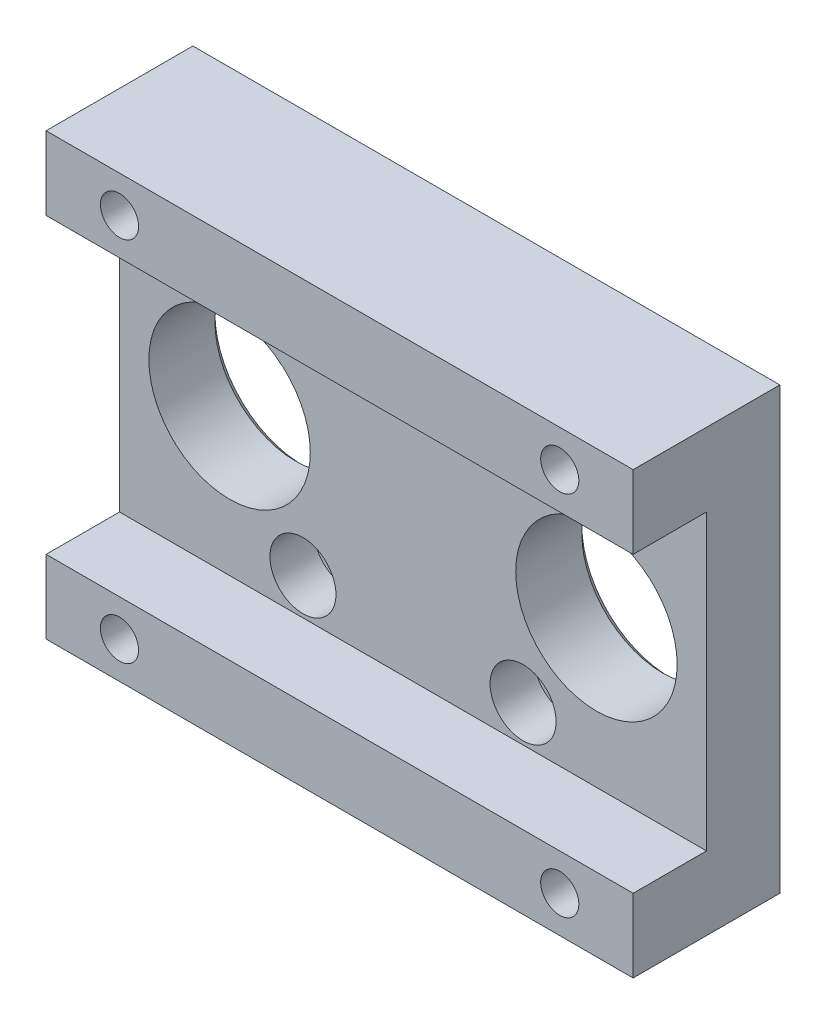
ISO-10303-21;
HEADER;
FILE_DESCRIPTION(('STEP AP214'),'2;1');
FILE_NAME('part.step','',(''),(''),'','','');
FILE_SCHEMA(('AUTOMOTIVE_DESIGN { 1 0 10303 214 1 1 1 1 }'));
ENDSEC;
DATA;
#1=APPLICATION_CONTEXT('core data for automotive mechanical design processes');
#2=APPLICATION_PROTOCOL_DEFINITION('international standard','automotive_design',2000,#1);
#3=PRODUCT_CONTEXT('',#1,'mechanical');
#4=PRODUCT('Part','Part','',(#3));
#5=PRODUCT_RELATED_PRODUCT_CATEGORY('part','',(#4));
#6=PRODUCT_DEFINITION_FORMATION('','',#4);
#7=PRODUCT_DEFINITION_CONTEXT('part definition',#1,'design');
#8=PRODUCT_DEFINITION('design','',#6,#7);
#9=PRODUCT_DEFINITION_SHAPE('','',#8);
#10=(LENGTH_UNIT() NAMED_UNIT(*) SI_UNIT(.MILLI.,.METRE.));
#11=(NAMED_UNIT(*) PLANE_ANGLE_UNIT() SI_UNIT($,.RADIAN.));
#12=(NAMED_UNIT(*) SI_UNIT($,.STERADIAN.) SOLID_ANGLE_UNIT());
#13=UNCERTAINTY_MEASURE_WITH_UNIT(LENGTH_MEASURE(1.E-05),#10,'distance_accuracy_value','');
#14=(GEOMETRIC_REPRESENTATION_CONTEXT(3) GLOBAL_UNCERTAINTY_ASSIGNED_CONTEXT((#13)) GLOBAL_UNIT_ASSIGNED_CONTEXT((#10,
#11,#12)) REPRESENTATION_CONTEXT('',''));
#15=CARTESIAN_POINT('',(0.,0.,0.));
#16=DIRECTION('',(0.,0.,1.));
#17=DIRECTION('',(1.,0.,0.));
#18=AXIS2_PLACEMENT_3D('',#15,#16,#17);
#19=CARTESIAN_POINT('',(15.,15.,10.));
#20=DIRECTION('',(0.,0.,-1.));
#21=DIRECTION('',(-1.,0.,0.));
#22=AXIS2_PLACEMENT_3D('',#19,#20,#21);
#23=CYLINDRICAL_SURFACE('',#22,2.6);
#24=CARTESIAN_POINT('',(15.,15.,0.));
#25=DIRECTION('',(0.,0.,-1.));
#26=DIRECTION('',(-1.,0.,0.));
#27=AXIS2_PLACEMENT_3D('',#24,#25,#26);
#28=CIRCLE('',#27,2.6);
#29=CARTESIAN_POINT('',(12.4,15.,0.));
#30=VERTEX_POINT('',#29);
#31=EDGE_CURVE('E225',#30,#30,#28,.T.);
#32=ORIENTED_EDGE('',*,*,#31,.T.);
#33=EDGE_LOOP('',(#32));
#34=FACE_BOUND('',#33,.T.);
#35=CARTESIAN_POINT('',(15.,15.,4.));
#36=DIRECTION('',(0.,0.,1.));
#37=DIRECTION('',(1.,0.,0.));
#38=AXIS2_PLACEMENT_3D('',#35,#36,#37);
#39=CIRCLE('',#38,2.6);
#40=CARTESIAN_POINT('',(17.6,15.,4.));
#41=VERTEX_POINT('',#40);
#42=EDGE_CURVE('E49',#41,#41,#39,.F.);
#43=ORIENTED_EDGE('',*,*,#42,.F.);
#44=EDGE_LOOP('',(#43));
#45=FACE_BOUND('',#44,.T.);
#46=ADVANCED_FACE('F44',(#34,#45),#23,.F.);
#47=CARTESIAN_POINT('',(-15.,15.,10.));
#48=DIRECTION('',(0.,0.,-1.));
#49=DIRECTION('',(-1.,0.,0.));
#50=AXIS2_PLACEMENT_3D('',#47,#48,#49);
#51=CYLINDRICAL_SURFACE('',#50,2.6);
#52=CARTESIAN_POINT('',(-15.,15.,0.));
#53=DIRECTION('',(0.,0.,-1.));
#54=DIRECTION('',(-1.,0.,0.));
#55=AXIS2_PLACEMENT_3D('',#52,#53,#54);
#56=CIRCLE('',#55,2.6);
#57=CARTESIAN_POINT('',(-17.6,15.,0.));
#58=VERTEX_POINT('',#57);
#59=EDGE_CURVE('E221',#58,#58,#56,.T.);
#60=ORIENTED_EDGE('',*,*,#59,.T.);
#61=EDGE_LOOP('',(#60));
#62=FACE_BOUND('',#61,.T.);
#63=CARTESIAN_POINT('',(-15.,15.,4.));
#64=DIRECTION('',(0.,0.,1.));
#65=DIRECTION('',(1.,0.,0.));
#66=AXIS2_PLACEMENT_3D('',#63,#64,#65);
#67=CIRCLE('',#66,2.6);
#68=CARTESIAN_POINT('',(-12.4,15.,4.));
#69=VERTEX_POINT('',#68);
#70=EDGE_CURVE('E207',#69,#69,#67,.F.);
#71=ORIENTED_EDGE('',*,*,#70,.F.);
#72=EDGE_LOOP('',(#71));
#73=FACE_BOUND('',#72,.T.);
#74=ADVANCED_FACE('F291',(#62,#73),#51,.F.);
#75=CARTESIAN_POINT('',(-15.,-15.,10.));
#76=DIRECTION('',(0.,0.,-1.));
#77=DIRECTION('',(-1.,0.,0.));
#78=AXIS2_PLACEMENT_3D('',#75,#76,#77);
#79=CYLINDRICAL_SURFACE('',#78,2.6);
#80=CARTESIAN_POINT('',(-15.,-15.,0.));
#81=DIRECTION('',(0.,0.,-1.));
#82=DIRECTION('',(-1.,0.,0.));
#83=AXIS2_PLACEMENT_3D('',#80,#81,#82);
#84=CIRCLE('',#83,2.6);
#85=CARTESIAN_POINT('',(-17.6,-15.,0.));
#86=VERTEX_POINT('',#85);
#87=EDGE_CURVE('E216',#86,#86,#84,.T.);
#88=ORIENTED_EDGE('',*,*,#87,.T.);
#89=EDGE_LOOP('',(#88));
#90=FACE_BOUND('',#89,.T.);
#91=CARTESIAN_POINT('',(-15.,-15.,4.));
#92=DIRECTION('',(0.,0.,1.));
#93=DIRECTION('',(1.,0.,0.));
#94=AXIS2_PLACEMENT_3D('',#91,#92,#93);
#95=CIRCLE('',#94,2.6);
#96=CARTESIAN_POINT('',(-12.4,-15.,4.));
#97=VERTEX_POINT('',#96);
#98=EDGE_CURVE('E204',#97,#97,#95,.F.);
#99=ORIENTED_EDGE('',*,*,#98,.F.);
#100=EDGE_LOOP('',(#99));
#101=FACE_BOUND('',#100,.T.);
#102=ADVANCED_FACE('F298',(#90,#101),#79,.F.);
#103=CARTESIAN_POINT('',(15.,-15.,10.));
#104=DIRECTION('',(0.,0.,-1.));
#105=DIRECTION('',(-1.,0.,0.));
#106=AXIS2_PLACEMENT_3D('',#103,#104,#105);
#107=CYLINDRICAL_SURFACE('',#106,2.6);
#108=CARTESIAN_POINT('',(15.,-15.,0.));
#109=DIRECTION('',(0.,0.,-1.));
#110=DIRECTION('',(-1.,0.,0.));
#111=AXIS2_PLACEMENT_3D('',#108,#109,#110);
#112=CIRCLE('',#111,2.6);
#113=CARTESIAN_POINT('',(12.4,-15.,0.));
#114=VERTEX_POINT('',#113);
#115=EDGE_CURVE('E212',#114,#114,#112,.T.);
#116=ORIENTED_EDGE('',*,*,#115,.T.);
#117=EDGE_LOOP('',(#116));
#118=FACE_BOUND('',#117,.T.);
#119=CARTESIAN_POINT('',(15.,-15.,4.));
#120=DIRECTION('',(0.,0.,1.));
#121=DIRECTION('',(1.,0.,0.));
#122=AXIS2_PLACEMENT_3D('',#119,#120,#121);
#123=CIRCLE('',#122,2.6);
#124=CARTESIAN_POINT('',(17.6,-15.,4.));
#125=VERTEX_POINT('',#124);
#126=EDGE_CURVE('E201',#125,#125,#123,.F.);
#127=ORIENTED_EDGE('',*,*,#126,.F.);
#128=EDGE_LOOP('',(#127));
#129=FACE_BOUND('',#128,.T.);
#130=ADVANCED_FACE('F304',(#118,#129),#107,.F.);
#131=CARTESIAN_POINT('',(-30.,-25.,0.));
#132=DIRECTION('',(0.,0.,1.));
#133=DIRECTION('',(1.,0.,0.));
#134=AXIS2_PLACEMENT_3D('',#131,#132,#133);
#135=CYLINDRICAL_SURFACE('',#134,2.6);
#136=CARTESIAN_POINT('',(-30.,-25.,20.));
#137=DIRECTION('',(0.,0.,1.));
#138=DIRECTION('',(1.,0.,0.));
#139=AXIS2_PLACEMENT_3D('',#136,#137,#138);
#140=CIRCLE('',#139,2.6);
#141=CARTESIAN_POINT('',(-27.4,-25.,20.));
#142=VERTEX_POINT('',#141);
#143=EDGE_CURVE('E261',#142,#142,#140,.T.);
#144=ORIENTED_EDGE('',*,*,#143,.T.);
#145=EDGE_LOOP('',(#144));
#146=FACE_BOUND('',#145,.T.);
#147=CARTESIAN_POINT('',(-30.,-25.,5.3));
#148=DIRECTION('',(0.,0.,-1.));
#149=DIRECTION('',(-1.,0.,0.));
#150=AXIS2_PLACEMENT_3D('',#147,#148,#149);
#151=CIRCLE('',#150,2.6);
#152=CARTESIAN_POINT('',(-32.6,-25.,5.3));
#153=VERTEX_POINT('',#152);
#154=EDGE_CURVE('E197',#153,#153,#151,.F.);
#155=ORIENTED_EDGE('',*,*,#154,.F.);
#156=EDGE_LOOP('',(#155));
#157=FACE_BOUND('',#156,.T.);
#158=ADVANCED_FACE('F352',(#146,#157),#135,.F.);
#159=CARTESIAN_POINT('',(30.,-25.,0.));
#160=DIRECTION('',(0.,0.,1.));
#161=DIRECTION('',(1.,0.,0.));
#162=AXIS2_PLACEMENT_3D('',#159,#160,#161);
#163=CYLINDRICAL_SURFACE('',#162,2.6);
#164=CARTESIAN_POINT('',(30.,-25.,20.));
#165=DIRECTION('',(0.,0.,1.));
#166=DIRECTION('',(1.,0.,0.));
#167=AXIS2_PLACEMENT_3D('',#164,#165,#166);
#168=CIRCLE('',#167,2.6);
#169=CARTESIAN_POINT('',(32.6,-25.,20.));
#170=VERTEX_POINT('',#169);
#171=EDGE_CURVE('E254',#170,#170,#168,.T.);
#172=ORIENTED_EDGE('',*,*,#171,.T.);
#173=EDGE_LOOP('',(#172));
#174=FACE_BOUND('',#173,.T.);
#175=CARTESIAN_POINT('',(30.,-25.,5.3));
#176=DIRECTION('',(0.,0.,-1.));
#177=DIRECTION('',(-1.,0.,0.));
#178=AXIS2_PLACEMENT_3D('',#175,#176,#177);
#179=CIRCLE('',#178,2.6);
#180=CARTESIAN_POINT('',(27.4,-25.,5.3));
#181=VERTEX_POINT('',#180);
#182=EDGE_CURVE('E194',#181,#181,#179,.F.);
#183=ORIENTED_EDGE('',*,*,#182,.F.);
#184=EDGE_LOOP('',(#183));
#185=FACE_BOUND('',#184,.T.);
#186=ADVANCED_FACE('F355',(#174,#185),#163,.F.);
#187=CARTESIAN_POINT('',(30.,25.,0.));
#188=DIRECTION('',(0.,0.,1.));
#189=DIRECTION('',(1.,0.,0.));
#190=AXIS2_PLACEMENT_3D('',#187,#188,#189);
#191=CYLINDRICAL_SURFACE('',#190,2.6);
#192=CARTESIAN_POINT('',(30.,25.,20.));
#193=DIRECTION('',(0.,0.,1.));
#194=DIRECTION('',(1.,0.,0.));
#195=AXIS2_PLACEMENT_3D('',#192,#193,#194);
#196=CIRCLE('',#195,2.6);
#197=CARTESIAN_POINT('',(32.6,25.,20.));
#198=VERTEX_POINT('',#197);
#199=EDGE_CURVE('E260',#198,#198,#196,.T.);
#200=ORIENTED_EDGE('',*,*,#199,.T.);
#201=EDGE_LOOP('',(#200));
#202=FACE_BOUND('',#201,.T.);
#203=CARTESIAN_POINT('',(30.,25.,5.3));
#204=DIRECTION('',(0.,0.,-1.));
#205=DIRECTION('',(-1.,0.,0.));
#206=AXIS2_PLACEMENT_3D('',#203,#204,#205);
#207=CIRCLE('',#206,2.6);
#208=CARTESIAN_POINT('',(27.4,25.,5.3));
#209=VERTEX_POINT('',#208);
#210=EDGE_CURVE('E190',#209,#209,#207,.F.);
#211=ORIENTED_EDGE('',*,*,#210,.F.);
#212=EDGE_LOOP('',(#211));
#213=FACE_BOUND('',#212,.T.);
#214=ADVANCED_FACE('F350',(#202,#213),#191,.F.);
#215=CARTESIAN_POINT('',(-30.,25.,0.));
#216=DIRECTION('',(0.,0.,1.));
#217=DIRECTION('',(1.,0.,0.));
#218=AXIS2_PLACEMENT_3D('',#215,#216,#217);
#219=CYLINDRICAL_SURFACE('',#218,2.6);
#220=CARTESIAN_POINT('',(-30.,25.,20.));
#221=DIRECTION('',(0.,0.,1.));
#222=DIRECTION('',(1.,0.,0.));
#223=AXIS2_PLACEMENT_3D('',#220,#221,#222);
#224=CIRCLE('',#223,2.6);
#225=CARTESIAN_POINT('',(-27.4,25.,20.));
#226=VERTEX_POINT('',#225);
#227=EDGE_CURVE('E257',#226,#226,#224,.T.);
#228=ORIENTED_EDGE('',*,*,#227,.T.);
#229=EDGE_LOOP('',(#228));
#230=FACE_BOUND('',#229,.T.);
#231=CARTESIAN_POINT('',(-30.,25.,5.3));
#232=DIRECTION('',(0.,0.,-1.));
#233=DIRECTION('',(-1.,0.,0.));
#234=AXIS2_PLACEMENT_3D('',#231,#232,#233);
#235=CIRCLE('',#234,2.6);
#236=CARTESIAN_POINT('',(-32.6,25.,5.3));
#237=VERTEX_POINT('',#236);
#238=EDGE_CURVE('E187',#237,#237,#235,.F.);
#239=ORIENTED_EDGE('',*,*,#238,.F.);
#240=EDGE_LOOP('',(#239));
#241=FACE_BOUND('',#240,.T.);
#242=ADVANCED_FACE('F346',(#230,#241),#219,.F.);
#243=CARTESIAN_POINT('',(0.,0.,10.));
#244=DIRECTION('',(0.,0.,1.));
#245=DIRECTION('',(1.,0.,0.));
#246=AXIS2_PLACEMENT_3D('',#243,#244,#245);
#247=PLANE('',#246);
#248=CARTESIAN_POINT('',(15.,-15.,10.));
#249=DIRECTION('',(0.,0.,1.));
#250=DIRECTION('',(1.,0.,0.));
#251=AXIS2_PLACEMENT_3D('',#248,#249,#250);
#252=CIRCLE('',#251,4.5);
#253=CARTESIAN_POINT('',(19.5,-15.,10.));
#254=VERTEX_POINT('',#253);
#255=EDGE_CURVE('E425',#254,#254,#252,.T.);
#256=ORIENTED_EDGE('',*,*,#255,.F.);
#257=EDGE_LOOP('',(#256));
#258=FACE_BOUND('',#257,.T.);
#259=CARTESIAN_POINT('',(-15.,-15.,10.));
#260=DIRECTION('',(0.,0.,1.));
#261=DIRECTION('',(1.,0.,0.));
#262=AXIS2_PLACEMENT_3D('',#259,#260,#261);
#263=CIRCLE('',#262,4.5);
#264=CARTESIAN_POINT('',(-10.5,-15.,10.));
#265=VERTEX_POINT('',#264);
#266=EDGE_CURVE('E429',#265,#265,#263,.T.);
#267=ORIENTED_EDGE('',*,*,#266,.F.);
#268=EDGE_LOOP('',(#267));
#269=FACE_BOUND('',#268,.T.);
#270=CARTESIAN_POINT('',(-15.,15.,10.));
#271=DIRECTION('',(0.,0.,1.));
#272=DIRECTION('',(1.,0.,0.));
#273=AXIS2_PLACEMENT_3D('',#270,#271,#272);
#274=CIRCLE('',#273,4.5);
#275=CARTESIAN_POINT('',(-10.5,15.,10.));
#276=VERTEX_POINT('',#275);
#277=EDGE_CURVE('E433',#276,#276,#274,.T.);
#278=ORIENTED_EDGE('',*,*,#277,.F.);
#279=EDGE_LOOP('',(#278));
#280=FACE_BOUND('',#279,.T.);
#281=CARTESIAN_POINT('',(15.,15.,10.));
#282=DIRECTION('',(0.,0.,1.));
#283=DIRECTION('',(1.,0.,0.));
#284=AXIS2_PLACEMENT_3D('',#281,#282,#283);
#285=CIRCLE('',#284,4.5);
#286=CARTESIAN_POINT('',(19.5,15.,10.));
#287=VERTEX_POINT('',#286);
#288=EDGE_CURVE('E437',#287,#287,#285,.T.);
#289=ORIENTED_EDGE('',*,*,#288,.F.);
#290=EDGE_LOOP('',(#289));
#291=FACE_BOUND('',#290,.T.);
#292=CARTESIAN_POINT('',(-25.,0.,10.));
#293=DIRECTION('',(0.,0.,1.));
#294=DIRECTION('',(1.,0.,0.));
#295=AXIS2_PLACEMENT_3D('',#292,#293,#294);
#296=CIRCLE('',#295,11.);
#297=CARTESIAN_POINT('',(-14.,0.,10.));
#298=VERTEX_POINT('',#297);
#299=EDGE_CURVE('E251',#298,#298,#296,.T.);
#300=ORIENTED_EDGE('',*,*,#299,.F.);
#301=EDGE_LOOP('',(#300));
#302=FACE_BOUND('',#301,.T.);
#303=CARTESIAN_POINT('',(25.,0.,10.));
#304=DIRECTION('',(0.,0.,1.));
#305=DIRECTION('',(1.,0.,0.));
#306=AXIS2_PLACEMENT_3D('',#303,#304,#305);
#307=CIRCLE('',#306,11.);
#308=CARTESIAN_POINT('',(36.,0.,10.));
#309=VERTEX_POINT('',#308);
#310=EDGE_CURVE('E200',#309,#309,#307,.T.);
#311=ORIENTED_EDGE('',*,*,#310,.F.);
#312=EDGE_LOOP('',(#311));
#313=FACE_BOUND('',#312,.T.);
#314=DIRECTION('',(0.,-1.,0.));
#315=VECTOR('',#314,1.);
#316=CARTESIAN_POINT('',(-40.,30.,10.));
#317=LINE('',#316,#315);
#318=CARTESIAN_POINT('',(-40.,20.,10.));
#319=VERTEX_POINT('',#318);
#320=CARTESIAN_POINT('',(-40.,-20.,10.));
#321=VERTEX_POINT('',#320);
#322=EDGE_CURVE('E67',#319,#321,#317,.T.);
#323=ORIENTED_EDGE('',*,*,#322,.T.);
#324=DIRECTION('',(-1.,0.,0.));
#325=VECTOR('',#324,1.);
#326=CARTESIAN_POINT('',(40.,-20.,10.));
#327=LINE('',#326,#325);
#328=CARTESIAN_POINT('',(40.,-20.,10.));
#329=VERTEX_POINT('',#328);
#330=EDGE_CURVE('E62',#329,#321,#327,.T.);
#331=ORIENTED_EDGE('',*,*,#330,.F.);
#332=DIRECTION('',(0.,1.,0.));
#333=VECTOR('',#332,1.);
#334=CARTESIAN_POINT('',(40.,30.,10.));
#335=LINE('',#334,#333);
#336=CARTESIAN_POINT('',(40.,20.,10.));
#337=VERTEX_POINT('',#336);
#338=EDGE_CURVE('E163',#329,#337,#335,.T.);
#339=ORIENTED_EDGE('',*,*,#338,.T.);
#340=DIRECTION('',(1.,0.,0.));
#341=VECTOR('',#340,1.);
#342=CARTESIAN_POINT('',(-40.,20.,10.));
#343=LINE('',#342,#341);
#344=EDGE_CURVE('E138',#319,#337,#343,.T.);
#345=ORIENTED_EDGE('',*,*,#344,.F.);
#346=EDGE_LOOP('',(#323,#331,#339,#345));
#347=FACE_BOUND('',#346,.T.);
#348=ADVANCED_FACE('F349',(#258,#269,#280,#291,#302,#313,#347),#247,.T.);
#349=CARTESIAN_POINT('',(40.,30.,10.));
#350=DIRECTION('',(-1.,0.,0.));
#351=DIRECTION('',(0.,-1.,0.));
#352=AXIS2_PLACEMENT_3D('',#349,#350,#351);
#353=PLANE('',#352);
#354=DIRECTION('',(0.,1.,0.));
#355=VECTOR('',#354,1.);
#356=CARTESIAN_POINT('',(40.,30.,0.));
#357=LINE('',#356,#355);
#358=CARTESIAN_POINT('',(40.,-30.,0.));
#359=VERTEX_POINT('',#358);
#360=CARTESIAN_POINT('',(40.,30.,0.));
#361=VERTEX_POINT('',#360);
#362=EDGE_CURVE('E162',#359,#361,#357,.T.);
#363=ORIENTED_EDGE('',*,*,#362,.T.);
#364=DIRECTION('',(0.,0.,-1.));
#365=VECTOR('',#364,1.);
#366=CARTESIAN_POINT('',(40.,30.,10.));
#367=LINE('',#366,#365);
#368=CARTESIAN_POINT('',(40.,30.,20.));
#369=VERTEX_POINT('',#368);
#370=EDGE_CURVE('E176',#369,#361,#367,.T.);
#371=ORIENTED_EDGE('',*,*,#370,.F.);
#372=DIRECTION('',(0.,1.,0.));
#373=VECTOR('',#372,1.);
#374=CARTESIAN_POINT('',(40.,30.,20.));
#375=LINE('',#374,#373);
#376=CARTESIAN_POINT('',(40.,20.,20.));
#377=VERTEX_POINT('',#376);
#378=EDGE_CURVE('E148',#377,#369,#375,.T.);
#379=ORIENTED_EDGE('',*,*,#378,.F.);
#380=DIRECTION('',(0.,0.,-1.));
#381=VECTOR('',#380,1.);
#382=CARTESIAN_POINT('',(40.,20.,20.));
#383=LINE('',#382,#381);
#384=EDGE_CURVE('E154',#377,#337,#383,.T.);
#385=ORIENTED_EDGE('',*,*,#384,.T.);
#386=ORIENTED_EDGE('',*,*,#338,.F.);
#387=DIRECTION('',(0.,0.,-1.));
#388=VECTOR('',#387,1.);
#389=CARTESIAN_POINT('',(40.,-20.,20.));
#390=LINE('',#389,#388);
#391=CARTESIAN_POINT('',(40.,-20.,20.));
#392=VERTEX_POINT('',#391);
#393=EDGE_CURVE('E135',#392,#329,#390,.T.);
#394=ORIENTED_EDGE('',*,*,#393,.F.);
#395=DIRECTION('',(0.,1.,0.));
#396=VECTOR('',#395,1.);
#397=CARTESIAN_POINT('',(40.,-30.,20.));
#398=LINE('',#397,#396);
#399=CARTESIAN_POINT('',(40.,-30.,20.));
#400=VERTEX_POINT('',#399);
#401=EDGE_CURVE('E127',#400,#392,#398,.T.);
#402=ORIENTED_EDGE('',*,*,#401,.F.);
#403=DIRECTION('',(0.,0.,-1.));
#404=VECTOR('',#403,1.);
#405=CARTESIAN_POINT('',(40.,-30.,10.));
#406=LINE('',#405,#404);
#407=EDGE_CURVE('E110',#400,#359,#406,.T.);
#408=ORIENTED_EDGE('',*,*,#407,.T.);
#409=EDGE_LOOP('',(#363,#371,#379,#385,#386,#394,#402,#408));
#410=FACE_BOUND('',#409,.T.);
#411=ADVANCED_FACE('F133',(#410),#353,.F.);
#412=CARTESIAN_POINT('',(-40.,30.,10.));
#413=DIRECTION('',(0.,-1.,0.));
#414=DIRECTION('',(0.,0.,-1.));
#415=AXIS2_PLACEMENT_3D('',#412,#413,#414);
#416=PLANE('',#415);
#417=DIRECTION('',(-1.,0.,0.));
#418=VECTOR('',#417,1.);
#419=CARTESIAN_POINT('',(-40.,30.,0.));
#420=LINE('',#419,#418);
#421=CARTESIAN_POINT('',(-40.,30.,0.));
#422=VERTEX_POINT('',#421);
#423=EDGE_CURVE('E167',#361,#422,#420,.T.);
#424=ORIENTED_EDGE('',*,*,#423,.T.);
#425=DIRECTION('',(0.,0.,-1.));
#426=VECTOR('',#425,1.);
#427=CARTESIAN_POINT('',(-40.,30.,10.));
#428=LINE('',#427,#426);
#429=CARTESIAN_POINT('',(-40.,30.,20.));
#430=VERTEX_POINT('',#429);
#431=EDGE_CURVE('E173',#430,#422,#428,.T.);
#432=ORIENTED_EDGE('',*,*,#431,.F.);
#433=DIRECTION('',(-1.,0.,0.));
#434=VECTOR('',#433,1.);
#435=CARTESIAN_POINT('',(-40.,30.,20.));
#436=LINE('',#435,#434);
#437=EDGE_CURVE('E151',#369,#430,#436,.T.);
#438=ORIENTED_EDGE('',*,*,#437,.F.);
#439=ORIENTED_EDGE('',*,*,#370,.T.);
#440=EDGE_LOOP('',(#424,#432,#438,#439));
#441=FACE_BOUND('',#440,.T.);
#442=ADVANCED_FACE('F375',(#441),#416,.F.);
#443=CARTESIAN_POINT('',(-40.,30.,10.));
#444=DIRECTION('',(1.,0.,0.));
#445=DIRECTION('',(0.,1.,0.));
#446=AXIS2_PLACEMENT_3D('',#443,#444,#445);
#447=PLANE('',#446);
#448=DIRECTION('',(0.,-1.,0.));
#449=VECTOR('',#448,1.);
#450=CARTESIAN_POINT('',(-40.,30.,0.));
#451=LINE('',#450,#449);
#452=CARTESIAN_POINT('',(-40.,-30.,0.));
#453=VERTEX_POINT('',#452);
#454=EDGE_CURVE('E169',#422,#453,#451,.T.);
#455=ORIENTED_EDGE('',*,*,#454,.T.);
#456=DIRECTION('',(0.,0.,-1.));
#457=VECTOR('',#456,1.);
#458=CARTESIAN_POINT('',(-40.,-30.,10.));
#459=LINE('',#458,#457);
#460=CARTESIAN_POINT('',(-40.,-30.,20.));
#461=VERTEX_POINT('',#460);
#462=EDGE_CURVE('E121',#461,#453,#459,.T.);
#463=ORIENTED_EDGE('',*,*,#462,.F.);
#464=DIRECTION('',(0.,-1.,0.));
#465=VECTOR('',#464,1.);
#466=CARTESIAN_POINT('',(-40.,-30.,20.));
#467=LINE('',#466,#465);
#468=CARTESIAN_POINT('',(-40.,-20.,20.));
#469=VERTEX_POINT('',#468);
#470=EDGE_CURVE('E130',#469,#461,#467,.T.);
#471=ORIENTED_EDGE('',*,*,#470,.F.);
#472=DIRECTION('',(0.,0.,-1.));
#473=VECTOR('',#472,1.);
#474=CARTESIAN_POINT('',(-40.,-20.,20.));
#475=LINE('',#474,#473);
#476=EDGE_CURVE('E131',#469,#321,#475,.T.);
#477=ORIENTED_EDGE('',*,*,#476,.T.);
#478=ORIENTED_EDGE('',*,*,#322,.F.);
#479=DIRECTION('',(0.,0.,-1.));
#480=VECTOR('',#479,1.);
#481=CARTESIAN_POINT('',(-40.,20.,20.));
#482=LINE('',#481,#480);
#483=CARTESIAN_POINT('',(-40.,20.,20.));
#484=VERTEX_POINT('',#483);
#485=EDGE_CURVE('E159',#484,#319,#482,.T.);
#486=ORIENTED_EDGE('',*,*,#485,.F.);
#487=DIRECTION('',(0.,-1.,0.));
#488=VECTOR('',#487,1.);
#489=CARTESIAN_POINT('',(-40.,30.,20.));
#490=LINE('',#489,#488);
#491=EDGE_CURVE('E143',#430,#484,#490,.T.);
#492=ORIENTED_EDGE('',*,*,#491,.F.);
#493=ORIENTED_EDGE('',*,*,#431,.T.);
#494=EDGE_LOOP('',(#455,#463,#471,#477,#478,#486,#492,#493));
#495=FACE_BOUND('',#494,.T.);
#496=ADVANCED_FACE('F272',(#495),#447,.F.);
#497=CARTESIAN_POINT('',(-40.,-30.,10.));
#498=DIRECTION('',(0.,1.,0.));
#499=DIRECTION('',(0.,0.,1.));
#500=AXIS2_PLACEMENT_3D('',#497,#498,#499);
#501=PLANE('',#500);
#502=DIRECTION('',(1.,0.,0.));
#503=VECTOR('',#502,1.);
#504=CARTESIAN_POINT('',(-40.,-30.,0.));
#505=LINE('',#504,#503);
#506=EDGE_CURVE('E116',#453,#359,#505,.T.);
#507=ORIENTED_EDGE('',*,*,#506,.T.);
#508=ORIENTED_EDGE('',*,*,#407,.F.);
#509=DIRECTION('',(1.,0.,0.));
#510=VECTOR('',#509,1.);
#511=CARTESIAN_POINT('',(40.,-30.,20.));
#512=LINE('',#511,#510);
#513=EDGE_CURVE('E114',#461,#400,#512,.T.);
#514=ORIENTED_EDGE('',*,*,#513,.F.);
#515=ORIENTED_EDGE('',*,*,#462,.T.);
#516=EDGE_LOOP('',(#507,#508,#514,#515));
#517=FACE_BOUND('',#516,.T.);
#518=ADVANCED_FACE('F112',(#517),#501,.F.);
#519=CARTESIAN_POINT('',(0.,0.,0.));
#520=DIRECTION('',(0.,0.,1.));
#521=DIRECTION('',(1.,0.,0.));
#522=AXIS2_PLACEMENT_3D('',#519,#520,#521);
#523=PLANE('',#522);
#524=ORIENTED_EDGE('',*,*,#115,.F.);
#525=EDGE_LOOP('',(#524));
#526=FACE_BOUND('',#525,.T.);
#527=ORIENTED_EDGE('',*,*,#87,.F.);
#528=EDGE_LOOP('',(#527));
#529=FACE_BOUND('',#528,.T.);
#530=ORIENTED_EDGE('',*,*,#59,.F.);
#531=EDGE_LOOP('',(#530));
#532=FACE_BOUND('',#531,.T.);
#533=ORIENTED_EDGE('',*,*,#31,.F.);
#534=EDGE_LOOP('',(#533));
#535=FACE_BOUND('',#534,.T.);
#536=CARTESIAN_POINT('',(30.,-25.,0.));
#537=DIRECTION('',(0.,0.,-1.));
#538=DIRECTION('',(-1.,0.,0.));
#539=AXIS2_PLACEMENT_3D('',#536,#537,#538);
#540=CIRCLE('',#539,4.5);
#541=CARTESIAN_POINT('',(25.5,-25.,0.));
#542=VERTEX_POINT('',#541);
#543=EDGE_CURVE('E242',#542,#542,#540,.T.);
#544=ORIENTED_EDGE('',*,*,#543,.F.);
#545=EDGE_LOOP('',(#544));
#546=FACE_BOUND('',#545,.T.);
#547=CARTESIAN_POINT('',(-30.,-25.,0.));
#548=DIRECTION('',(0.,0.,-1.));
#549=DIRECTION('',(-1.,0.,0.));
#550=AXIS2_PLACEMENT_3D('',#547,#548,#549);
#551=CIRCLE('',#550,4.5);
#552=CARTESIAN_POINT('',(-34.5,-25.,0.));
#553=VERTEX_POINT('',#552);
#554=EDGE_CURVE('E236',#553,#553,#551,.T.);
#555=ORIENTED_EDGE('',*,*,#554,.F.);
#556=EDGE_LOOP('',(#555));
#557=FACE_BOUND('',#556,.T.);
#558=CARTESIAN_POINT('',(-30.,25.,0.));
#559=DIRECTION('',(0.,0.,-1.));
#560=DIRECTION('',(-1.,0.,0.));
#561=AXIS2_PLACEMENT_3D('',#558,#559,#560);
#562=CIRCLE('',#561,4.5);
#563=CARTESIAN_POINT('',(-34.5,25.,0.));
#564=VERTEX_POINT('',#563);
#565=EDGE_CURVE('E229',#564,#564,#562,.T.);
#566=ORIENTED_EDGE('',*,*,#565,.F.);
#567=EDGE_LOOP('',(#566));
#568=FACE_BOUND('',#567,.T.);
#569=CARTESIAN_POINT('',(30.,25.,0.));
#570=DIRECTION('',(0.,0.,-1.));
#571=DIRECTION('',(-1.,0.,0.));
#572=AXIS2_PLACEMENT_3D('',#569,#570,#571);
#573=CIRCLE('',#572,4.5);
#574=CARTESIAN_POINT('',(25.5,25.,0.));
#575=VERTEX_POINT('',#574);
#576=EDGE_CURVE('E232',#575,#575,#573,.T.);
#577=ORIENTED_EDGE('',*,*,#576,.F.);
#578=EDGE_LOOP('',(#577));
#579=FACE_BOUND('',#578,.T.);
#580=CARTESIAN_POINT('',(25.,0.,0.));
#581=DIRECTION('',(0.,0.,1.));
#582=DIRECTION('',(1.,0.,0.));
#583=AXIS2_PLACEMENT_3D('',#580,#581,#582);
#584=CIRCLE('',#583,12.);
#585=CARTESIAN_POINT('',(37.,0.,0.));
#586=VERTEX_POINT('',#585);
#587=EDGE_CURVE('E182',#586,#586,#584,.T.);
#588=ORIENTED_EDGE('',*,*,#587,.T.);
#589=EDGE_LOOP('',(#588));
#590=FACE_BOUND('',#589,.T.);
#591=CARTESIAN_POINT('',(-25.,0.,0.));
#592=DIRECTION('',(0.,0.,1.));
#593=DIRECTION('',(1.,0.,0.));
#594=AXIS2_PLACEMENT_3D('',#591,#592,#593);
#595=CIRCLE('',#594,12.);
#596=CARTESIAN_POINT('',(-13.,0.,0.));
#597=VERTEX_POINT('',#596);
#598=EDGE_CURVE('E179',#597,#597,#595,.T.);
#599=ORIENTED_EDGE('',*,*,#598,.T.);
#600=EDGE_LOOP('',(#599));
#601=FACE_BOUND('',#600,.T.);
#602=ORIENTED_EDGE('',*,*,#362,.F.);
#603=ORIENTED_EDGE('',*,*,#506,.F.);
#604=ORIENTED_EDGE('',*,*,#454,.F.);
#605=ORIENTED_EDGE('',*,*,#423,.F.);
#606=EDGE_LOOP('',(#602,#603,#604,#605));
#607=FACE_BOUND('',#606,.T.);
#608=ADVANCED_FACE('F378',(#526,#529,#532,#535,#546,#557,#568,#579,#590,#601,#607),#523,.F.);
#609=CARTESIAN_POINT('',(-40.,20.,20.));
#610=DIRECTION('',(0.,1.,0.));
#611=DIRECTION('',(-1.,0.,0.));
#612=AXIS2_PLACEMENT_3D('',#609,#610,#611);
#613=PLANE('',#612);
#614=ORIENTED_EDGE('',*,*,#344,.T.);
#615=ORIENTED_EDGE('',*,*,#384,.F.);
#616=DIRECTION('',(1.,0.,0.));
#617=VECTOR('',#616,1.);
#618=CARTESIAN_POINT('',(-40.,20.,20.));
#619=LINE('',#618,#617);
#620=EDGE_CURVE('E146',#484,#377,#619,.T.);
#621=ORIENTED_EDGE('',*,*,#620,.F.);
#622=ORIENTED_EDGE('',*,*,#485,.T.);
#623=EDGE_LOOP('',(#614,#615,#621,#622));
#624=FACE_BOUND('',#623,.T.);
#625=ADVANCED_FACE('F286',(#624),#613,.F.);
#626=CARTESIAN_POINT('',(0.,0.,20.));
#627=DIRECTION('',(0.,0.,1.));
#628=DIRECTION('',(1.,0.,0.));
#629=AXIS2_PLACEMENT_3D('',#626,#627,#628);
#630=PLANE('',#629);
#631=ORIENTED_EDGE('',*,*,#227,.F.);
#632=EDGE_LOOP('',(#631));
#633=FACE_BOUND('',#632,.T.);
#634=ORIENTED_EDGE('',*,*,#199,.F.);
#635=EDGE_LOOP('',(#634));
#636=FACE_BOUND('',#635,.T.);
#637=ORIENTED_EDGE('',*,*,#491,.T.);
#638=ORIENTED_EDGE('',*,*,#620,.T.);
#639=ORIENTED_EDGE('',*,*,#378,.T.);
#640=ORIENTED_EDGE('',*,*,#437,.T.);
#641=EDGE_LOOP('',(#637,#638,#639,#640));
#642=FACE_BOUND('',#641,.T.);
#643=ADVANCED_FACE('F277',(#633,#636,#642),#630,.T.);
#644=CARTESIAN_POINT('',(40.,-20.,20.));
#645=DIRECTION('',(0.,-1.,0.));
#646=DIRECTION('',(1.,0.,0.));
#647=AXIS2_PLACEMENT_3D('',#644,#645,#646);
#648=PLANE('',#647);
#649=ORIENTED_EDGE('',*,*,#330,.T.);
#650=ORIENTED_EDGE('',*,*,#476,.F.);
#651=DIRECTION('',(-1.,0.,0.));
#652=VECTOR('',#651,1.);
#653=CARTESIAN_POINT('',(40.,-20.,20.));
#654=LINE('',#653,#652);
#655=EDGE_CURVE('E136',#392,#469,#654,.T.);
#656=ORIENTED_EDGE('',*,*,#655,.F.);
#657=ORIENTED_EDGE('',*,*,#393,.T.);
#658=EDGE_LOOP('',(#649,#650,#656,#657));
#659=FACE_BOUND('',#658,.T.);
#660=ADVANCED_FACE('F275',(#659),#648,.F.);
#661=CARTESIAN_POINT('',(0.,0.,20.));
#662=DIRECTION('',(0.,0.,1.));
#663=DIRECTION('',(1.,0.,0.));
#664=AXIS2_PLACEMENT_3D('',#661,#662,#663);
#665=PLANE('',#664);
#666=ORIENTED_EDGE('',*,*,#171,.F.);
#667=EDGE_LOOP('',(#666));
#668=FACE_BOUND('',#667,.T.);
#669=ORIENTED_EDGE('',*,*,#143,.F.);
#670=EDGE_LOOP('',(#669));
#671=FACE_BOUND('',#670,.T.);
#672=ORIENTED_EDGE('',*,*,#401,.T.);
#673=ORIENTED_EDGE('',*,*,#655,.T.);
#674=ORIENTED_EDGE('',*,*,#470,.T.);
#675=ORIENTED_EDGE('',*,*,#513,.T.);
#676=EDGE_LOOP('',(#672,#673,#674,#675));
#677=FACE_BOUND('',#676,.T.);
#678=ADVANCED_FACE('F126',(#668,#671,#677),#665,.T.);
#679=CARTESIAN_POINT('',(25.,0.,-2.2));
#680=DIRECTION('',(0.,0.,1.));
#681=DIRECTION('',(1.,0.,0.));
#682=AXIS2_PLACEMENT_3D('',#679,#680,#681);
#683=CYLINDRICAL_SURFACE('',#682,11.);
#684=CARTESIAN_POINT('',(25.,0.,0.999999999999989));
#685=DIRECTION('',(0.,0.,1.));
#686=DIRECTION('',(1.,0.,0.));
#687=AXIS2_PLACEMENT_3D('',#684,#685,#686);
#688=CIRCLE('',#687,11.);
#689=CARTESIAN_POINT('',(36.,0.,0.999999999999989));
#690=VERTEX_POINT('',#689);
#691=EDGE_CURVE('E54',#690,#690,#688,.F.);
#692=ORIENTED_EDGE('',*,*,#691,.T.);
#693=EDGE_LOOP('',(#692));
#694=FACE_BOUND('',#693,.T.);
#695=ORIENTED_EDGE('',*,*,#310,.T.);
#696=EDGE_LOOP('',(#695));
#697=FACE_BOUND('',#696,.T.);
#698=ADVANCED_FACE('F283',(#694,#697),#683,.F.);
#699=CARTESIAN_POINT('',(-25.,0.,-2.2));
#700=DIRECTION('',(0.,0.,1.));
#701=DIRECTION('',(1.,0.,0.));
#702=AXIS2_PLACEMENT_3D('',#699,#700,#701);
#703=CYLINDRICAL_SURFACE('',#702,11.);
#704=CARTESIAN_POINT('',(-25.,0.,0.999999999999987));
#705=DIRECTION('',(0.,0.,1.));
#706=DIRECTION('',(1.,0.,0.));
#707=AXIS2_PLACEMENT_3D('',#704,#705,#706);
#708=CIRCLE('',#707,11.);
#709=CARTESIAN_POINT('',(-14.,0.,0.999999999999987));
#710=VERTEX_POINT('',#709);
#711=EDGE_CURVE('E11',#710,#710,#708,.F.);
#712=ORIENTED_EDGE('',*,*,#711,.T.);
#713=EDGE_LOOP('',(#712));
#714=FACE_BOUND('',#713,.T.);
#715=ORIENTED_EDGE('',*,*,#299,.T.);
#716=EDGE_LOOP('',(#715));
#717=FACE_BOUND('',#716,.T.);
#718=ADVANCED_FACE('F338',(#714,#717),#703,.F.);
#719=CARTESIAN_POINT('',(25.,0.,0.));
#720=DIRECTION('',(0.,0.,-1.));
#721=DIRECTION('',(-1.,0.,0.));
#722=AXIS2_PLACEMENT_3D('',#719,#720,#721);
#723=CONICAL_SURFACE('',#722,12.,0.785398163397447);
#724=ORIENTED_EDGE('',*,*,#691,.F.);
#725=EDGE_LOOP('',(#724));
#726=FACE_BOUND('',#725,.T.);
#727=ORIENTED_EDGE('',*,*,#587,.F.);
#728=EDGE_LOOP('',(#727));
#729=FACE_BOUND('',#728,.T.);
#730=ADVANCED_FACE('F341',(#726,#729),#723,.F.);
#731=CARTESIAN_POINT('',(-25.,0.,0.));
#732=DIRECTION('',(0.,0.,-1.));
#733=DIRECTION('',(-1.,0.,0.));
#734=AXIS2_PLACEMENT_3D('',#731,#732,#733);
#735=CONICAL_SURFACE('',#734,12.,0.785398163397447);
#736=ORIENTED_EDGE('',*,*,#711,.F.);
#737=EDGE_LOOP('',(#736));
#738=FACE_BOUND('',#737,.T.);
#739=ORIENTED_EDGE('',*,*,#598,.F.);
#740=EDGE_LOOP('',(#739));
#741=FACE_BOUND('',#740,.T.);
#742=ADVANCED_FACE('F47',(#738,#741),#735,.F.);
#743=CARTESIAN_POINT('',(-30.,25.,5.3));
#744=DIRECTION('',(0.,0.,-1.));
#745=DIRECTION('',(-1.,0.,0.));
#746=AXIS2_PLACEMENT_3D('',#743,#744,#745);
#747=PLANE('',#746);
#748=CARTESIAN_POINT('',(-30.,25.,5.3));
#749=DIRECTION('',(0.,0.,-1.));
#750=DIRECTION('',(-1.,0.,0.));
#751=AXIS2_PLACEMENT_3D('',#748,#749,#750);
#752=CIRCLE('',#751,4.5);
#753=CARTESIAN_POINT('',(-34.5,25.,5.3));
#754=VERTEX_POINT('',#753);
#755=EDGE_CURVE('E233',#754,#754,#752,.T.);
#756=ORIENTED_EDGE('',*,*,#755,.T.);
#757=EDGE_LOOP('',(#756));
#758=FACE_BOUND('',#757,.T.);
#759=ORIENTED_EDGE('',*,*,#238,.T.);
#760=EDGE_LOOP('',(#759));
#761=FACE_BOUND('',#760,.T.);
#762=ADVANCED_FACE('F310',(#758,#761),#747,.T.);
#763=CARTESIAN_POINT('',(-30.,25.,5.3));
#764=DIRECTION('',(0.,0.,-1.));
#765=DIRECTION('',(-1.,0.,0.));
#766=AXIS2_PLACEMENT_3D('',#763,#764,#765);
#767=CYLINDRICAL_SURFACE('',#766,4.5);
#768=ORIENTED_EDGE('',*,*,#755,.F.);
#769=EDGE_LOOP('',(#768));
#770=FACE_BOUND('',#769,.T.);
#771=ORIENTED_EDGE('',*,*,#565,.T.);
#772=EDGE_LOOP('',(#771));
#773=FACE_BOUND('',#772,.T.);
#774=ADVANCED_FACE('F306',(#770,#773),#767,.F.);
#775=CARTESIAN_POINT('',(30.,25.,5.3));
#776=DIRECTION('',(0.,0.,-1.));
#777=DIRECTION('',(-1.,0.,0.));
#778=AXIS2_PLACEMENT_3D('',#775,#776,#777);
#779=PLANE('',#778);
#780=CARTESIAN_POINT('',(30.,25.,5.3));
#781=DIRECTION('',(0.,0.,-1.));
#782=DIRECTION('',(-1.,0.,0.));
#783=AXIS2_PLACEMENT_3D('',#780,#781,#782);
#784=CIRCLE('',#783,4.5);
#785=CARTESIAN_POINT('',(25.5,25.,5.3));
#786=VERTEX_POINT('',#785);
#787=EDGE_CURVE('E191',#786,#786,#784,.T.);
#788=ORIENTED_EDGE('',*,*,#787,.T.);
#789=EDGE_LOOP('',(#788));
#790=FACE_BOUND('',#789,.T.);
#791=ORIENTED_EDGE('',*,*,#210,.T.);
#792=EDGE_LOOP('',(#791));
#793=FACE_BOUND('',#792,.T.);
#794=ADVANCED_FACE('F309',(#790,#793),#779,.T.);
#795=CARTESIAN_POINT('',(30.,25.,5.3));
#796=DIRECTION('',(0.,0.,-1.));
#797=DIRECTION('',(-1.,0.,0.));
#798=AXIS2_PLACEMENT_3D('',#795,#796,#797);
#799=CYLINDRICAL_SURFACE('',#798,4.5);
#800=ORIENTED_EDGE('',*,*,#787,.F.);
#801=EDGE_LOOP('',(#800));
#802=FACE_BOUND('',#801,.T.);
#803=ORIENTED_EDGE('',*,*,#576,.T.);
#804=EDGE_LOOP('',(#803));
#805=FACE_BOUND('',#804,.T.);
#806=ADVANCED_FACE('F330',(#802,#805),#799,.F.);
#807=CARTESIAN_POINT('',(30.,-25.,5.3));
#808=DIRECTION('',(0.,0.,-1.));
#809=DIRECTION('',(-1.,0.,0.));
#810=AXIS2_PLACEMENT_3D('',#807,#808,#809);
#811=PLANE('',#810);
#812=CARTESIAN_POINT('',(30.,-25.,5.3));
#813=DIRECTION('',(0.,0.,-1.));
#814=DIRECTION('',(-1.,0.,0.));
#815=AXIS2_PLACEMENT_3D('',#812,#813,#814);
#816=CIRCLE('',#815,4.5);
#817=CARTESIAN_POINT('',(25.5,-25.,5.3));
#818=VERTEX_POINT('',#817);
#819=EDGE_CURVE('E228',#818,#818,#816,.T.);
#820=ORIENTED_EDGE('',*,*,#819,.T.);
#821=EDGE_LOOP('',(#820));
#822=FACE_BOUND('',#821,.T.);
#823=ORIENTED_EDGE('',*,*,#182,.T.);
#824=EDGE_LOOP('',(#823));
#825=FACE_BOUND('',#824,.T.);
#826=ADVANCED_FACE('F326',(#822,#825),#811,.T.);
#827=CARTESIAN_POINT('',(30.,-25.,5.3));
#828=DIRECTION('',(0.,0.,-1.));
#829=DIRECTION('',(-1.,0.,0.));
#830=AXIS2_PLACEMENT_3D('',#827,#828,#829);
#831=CYLINDRICAL_SURFACE('',#830,4.5);
#832=ORIENTED_EDGE('',*,*,#819,.F.);
#833=EDGE_LOOP('',(#832));
#834=FACE_BOUND('',#833,.T.);
#835=ORIENTED_EDGE('',*,*,#543,.T.);
#836=EDGE_LOOP('',(#835));
#837=FACE_BOUND('',#836,.T.);
#838=ADVANCED_FACE('F322',(#834,#837),#831,.F.);
#839=CARTESIAN_POINT('',(-30.,-25.,5.3));
#840=DIRECTION('',(0.,0.,-1.));
#841=DIRECTION('',(-1.,0.,0.));
#842=AXIS2_PLACEMENT_3D('',#839,#840,#841);
#843=PLANE('',#842);
#844=CARTESIAN_POINT('',(-30.,-25.,5.3));
#845=DIRECTION('',(0.,0.,-1.));
#846=DIRECTION('',(-1.,0.,0.));
#847=AXIS2_PLACEMENT_3D('',#844,#845,#846);
#848=CIRCLE('',#847,4.5);
#849=CARTESIAN_POINT('',(-34.5,-25.,5.3));
#850=VERTEX_POINT('',#849);
#851=EDGE_CURVE('E239',#850,#850,#848,.T.);
#852=ORIENTED_EDGE('',*,*,#851,.T.);
#853=EDGE_LOOP('',(#852));
#854=FACE_BOUND('',#853,.T.);
#855=ORIENTED_EDGE('',*,*,#154,.T.);
#856=EDGE_LOOP('',(#855));
#857=FACE_BOUND('',#856,.T.);
#858=ADVANCED_FACE('F318',(#854,#857),#843,.T.);
#859=CARTESIAN_POINT('',(-30.,-25.,5.3));
#860=DIRECTION('',(0.,0.,-1.));
#861=DIRECTION('',(-1.,0.,0.));
#862=AXIS2_PLACEMENT_3D('',#859,#860,#861);
#863=CYLINDRICAL_SURFACE('',#862,4.5);
#864=ORIENTED_EDGE('',*,*,#851,.F.);
#865=EDGE_LOOP('',(#864));
#866=FACE_BOUND('',#865,.T.);
#867=ORIENTED_EDGE('',*,*,#554,.T.);
#868=EDGE_LOOP('',(#867));
#869=FACE_BOUND('',#868,.T.);
#870=ADVANCED_FACE('F315',(#866,#869),#863,.F.);
#871=CARTESIAN_POINT('',(15.,-15.,4.));
#872=DIRECTION('',(0.,0.,1.));
#873=DIRECTION('',(1.,0.,0.));
#874=AXIS2_PLACEMENT_3D('',#871,#872,#873);
#875=PLANE('',#874);
#876=CARTESIAN_POINT('',(15.,-15.,4.));
#877=DIRECTION('',(0.,0.,1.));
#878=DIRECTION('',(1.,0.,0.));
#879=AXIS2_PLACEMENT_3D('',#876,#877,#878);
#880=CIRCLE('',#879,4.5);
#881=CARTESIAN_POINT('',(19.5,-15.,4.));
#882=VERTEX_POINT('',#881);
#883=EDGE_CURVE('E465',#882,#882,#880,.T.);
#884=ORIENTED_EDGE('',*,*,#883,.T.);
#885=EDGE_LOOP('',(#884));
#886=FACE_BOUND('',#885,.T.);
#887=ORIENTED_EDGE('',*,*,#126,.T.);
#888=EDGE_LOOP('',(#887));
#889=FACE_BOUND('',#888,.T.);
#890=ADVANCED_FACE('F317',(#886,#889),#875,.T.);
#891=CARTESIAN_POINT('',(15.,-15.,4.));
#892=DIRECTION('',(0.,0.,1.));
#893=DIRECTION('',(1.,0.,0.));
#894=AXIS2_PLACEMENT_3D('',#891,#892,#893);
#895=CYLINDRICAL_SURFACE('',#894,4.5);
#896=ORIENTED_EDGE('',*,*,#883,.F.);
#897=EDGE_LOOP('',(#896));
#898=FACE_BOUND('',#897,.T.);
#899=ORIENTED_EDGE('',*,*,#255,.T.);
#900=EDGE_LOOP('',(#899));
#901=FACE_BOUND('',#900,.T.);
#902=ADVANCED_FACE('F499',(#898,#901),#895,.F.);
#903=CARTESIAN_POINT('',(-15.,-15.,4.));
#904=DIRECTION('',(0.,0.,1.));
#905=DIRECTION('',(1.,0.,0.));
#906=AXIS2_PLACEMENT_3D('',#903,#904,#905);
#907=PLANE('',#906);
#908=CARTESIAN_POINT('',(-15.,-15.,4.));
#909=DIRECTION('',(0.,0.,1.));
#910=DIRECTION('',(1.,0.,0.));
#911=AXIS2_PLACEMENT_3D('',#908,#909,#910);
#912=CIRCLE('',#911,4.5);
#913=CARTESIAN_POINT('',(-10.5,-15.,4.));
#914=VERTEX_POINT('',#913);
#915=EDGE_CURVE('E469',#914,#914,#912,.T.);
#916=ORIENTED_EDGE('',*,*,#915,.T.);
#917=EDGE_LOOP('',(#916));
#918=FACE_BOUND('',#917,.T.);
#919=ORIENTED_EDGE('',*,*,#98,.T.);
#920=EDGE_LOOP('',(#919));
#921=FACE_BOUND('',#920,.T.);
#922=ADVANCED_FACE('F495',(#918,#921),#907,.T.);
#923=CARTESIAN_POINT('',(-15.,-15.,4.));
#924=DIRECTION('',(0.,0.,1.));
#925=DIRECTION('',(1.,0.,0.));
#926=AXIS2_PLACEMENT_3D('',#923,#924,#925);
#927=CYLINDRICAL_SURFACE('',#926,4.5);
#928=ORIENTED_EDGE('',*,*,#915,.F.);
#929=EDGE_LOOP('',(#928));
#930=FACE_BOUND('',#929,.T.);
#931=ORIENTED_EDGE('',*,*,#266,.T.);
#932=EDGE_LOOP('',(#931));
#933=FACE_BOUND('',#932,.T.);
#934=ADVANCED_FACE('F490',(#930,#933),#927,.F.);
#935=CARTESIAN_POINT('',(-15.,15.,4.));
#936=DIRECTION('',(0.,0.,1.));
#937=DIRECTION('',(1.,0.,0.));
#938=AXIS2_PLACEMENT_3D('',#935,#936,#937);
#939=PLANE('',#938);
#940=CARTESIAN_POINT('',(-15.,15.,4.));
#941=DIRECTION('',(0.,0.,1.));
#942=DIRECTION('',(1.,0.,0.));
#943=AXIS2_PLACEMENT_3D('',#940,#941,#942);
#944=CIRCLE('',#943,4.5);
#945=CARTESIAN_POINT('',(-10.5,15.,4.));
#946=VERTEX_POINT('',#945);
#947=EDGE_CURVE('E444',#946,#946,#944,.T.);
#948=ORIENTED_EDGE('',*,*,#947,.T.);
#949=EDGE_LOOP('',(#948));
#950=FACE_BOUND('',#949,.T.);
#951=ORIENTED_EDGE('',*,*,#70,.T.);
#952=EDGE_LOOP('',(#951));
#953=FACE_BOUND('',#952,.T.);
#954=ADVANCED_FACE('F476',(#950,#953),#939,.T.);
#955=CARTESIAN_POINT('',(-15.,15.,4.));
#956=DIRECTION('',(0.,0.,1.));
#957=DIRECTION('',(1.,0.,0.));
#958=AXIS2_PLACEMENT_3D('',#955,#956,#957);
#959=CYLINDRICAL_SURFACE('',#958,4.5);
#960=ORIENTED_EDGE('',*,*,#947,.F.);
#961=EDGE_LOOP('',(#960));
#962=FACE_BOUND('',#961,.T.);
#963=ORIENTED_EDGE('',*,*,#277,.T.);
#964=EDGE_LOOP('',(#963));
#965=FACE_BOUND('',#964,.T.);
#966=ADVANCED_FACE('F478',(#962,#965),#959,.F.);
#967=CARTESIAN_POINT('',(15.,15.,4.));
#968=DIRECTION('',(0.,0.,1.));
#969=DIRECTION('',(1.,0.,0.));
#970=AXIS2_PLACEMENT_3D('',#967,#968,#969);
#971=PLANE('',#970);
#972=CARTESIAN_POINT('',(15.,15.,4.));
#973=DIRECTION('',(0.,0.,1.));
#974=DIRECTION('',(1.,0.,0.));
#975=AXIS2_PLACEMENT_3D('',#972,#973,#974);
#976=CIRCLE('',#975,4.5);
#977=CARTESIAN_POINT('',(19.5,15.,4.));
#978=VERTEX_POINT('',#977);
#979=EDGE_CURVE('E205',#978,#978,#976,.T.);
#980=ORIENTED_EDGE('',*,*,#979,.T.);
#981=EDGE_LOOP('',(#980));
#982=FACE_BOUND('',#981,.T.);
#983=ORIENTED_EDGE('',*,*,#42,.T.);
#984=EDGE_LOOP('',(#983));
#985=FACE_BOUND('',#984,.T.);
#986=ADVANCED_FACE('F481',(#982,#985),#971,.T.);
#987=CARTESIAN_POINT('',(15.,15.,4.));
#988=DIRECTION('',(0.,0.,1.));
#989=DIRECTION('',(1.,0.,0.));
#990=AXIS2_PLACEMENT_3D('',#987,#988,#989);
#991=CYLINDRICAL_SURFACE('',#990,4.5);
#992=ORIENTED_EDGE('',*,*,#979,.F.);
#993=EDGE_LOOP('',(#992));
#994=FACE_BOUND('',#993,.T.);
#995=ORIENTED_EDGE('',*,*,#288,.T.);
#996=EDGE_LOOP('',(#995));
#997=FACE_BOUND('',#996,.T.);
#998=ADVANCED_FACE('F487',(#994,#997),#991,.F.);
#999=CLOSED_SHELL('',(#46,#74,#102,#130,#158,#186,#214,#242,#348,#411,#442,#496,#518,#608,#625,
#643,#660,#678,#698,#718,#730,#742,#762,#774,#794,#806,#826,#838,#858,#870,#890,#902,#922,#934,
#954,#966,#986,#998));
#1000=MANIFOLD_SOLID_BREP('B2',#999);
#1001=ADVANCED_BREP_SHAPE_REPRESENTATION('',(#18,#1000),#14);
#1002=SHAPE_DEFINITION_REPRESENTATION(#9,#1001);
ENDSEC;
END-ISO-10303-21;
